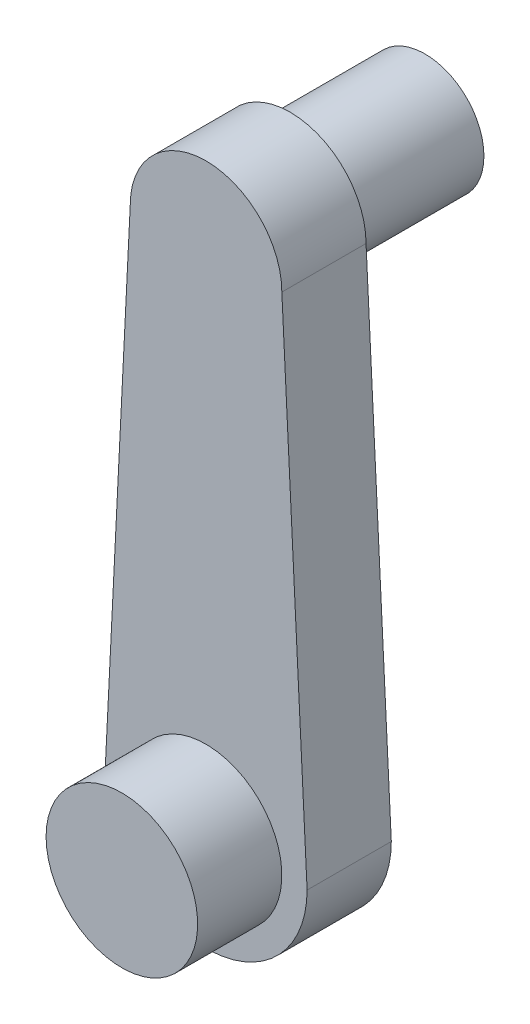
from build123d import *

# Parameters (mm, degrees)
BASE_EXTRUDE_DEPTH  = 12.7
SKETCH2_R           = 8.89
BOSS_EXTRUDE1_DEPTH = 20.32
SKETCH3_R           = 11.43
BOSS_EXTRUDE2_DEPTH = 12.7


with BuildPart() as part:
    # Sketch1 → Base-Extrude (new body)
    with BuildSketch(Plane.XY):
        with BuildLine():
            Line((-11.43, 76.2), (-15.24, 0))
            ThreePointArc((-15.24, 0), (0, -15.24), (15.24, 0))
            Line((15.24, 0), (11.43, 76.2))
            ThreePointArc((11.43, 76.2), (0, 87.63), (-11.43, 76.2))
        make_face()
    extrude(amount=BASE_EXTRUDE_DEPTH)

    # Sketch2 → Boss-Extrude1 (add)
    with BuildSketch(Plane(origin=(0, 0, 0), x_dir=(-1, 0, 0), z_dir=(0, 0, -1))):
        with Locations(Location((0, 76.2, 0), (0, 0, 180))):
            Circle(SKETCH2_R)
    extrude(amount=BOSS_EXTRUDE1_DEPTH)

    # Sketch3 → Boss-Extrude2 (add)
    with BuildSketch(Plane.XY.offset(12.7)):
        with Locations(Location((0, 0, 0), (0, 0, 180))):
            Circle(SKETCH3_R)
    extrude(amount=BOSS_EXTRUDE2_DEPTH)


solid = part.part
